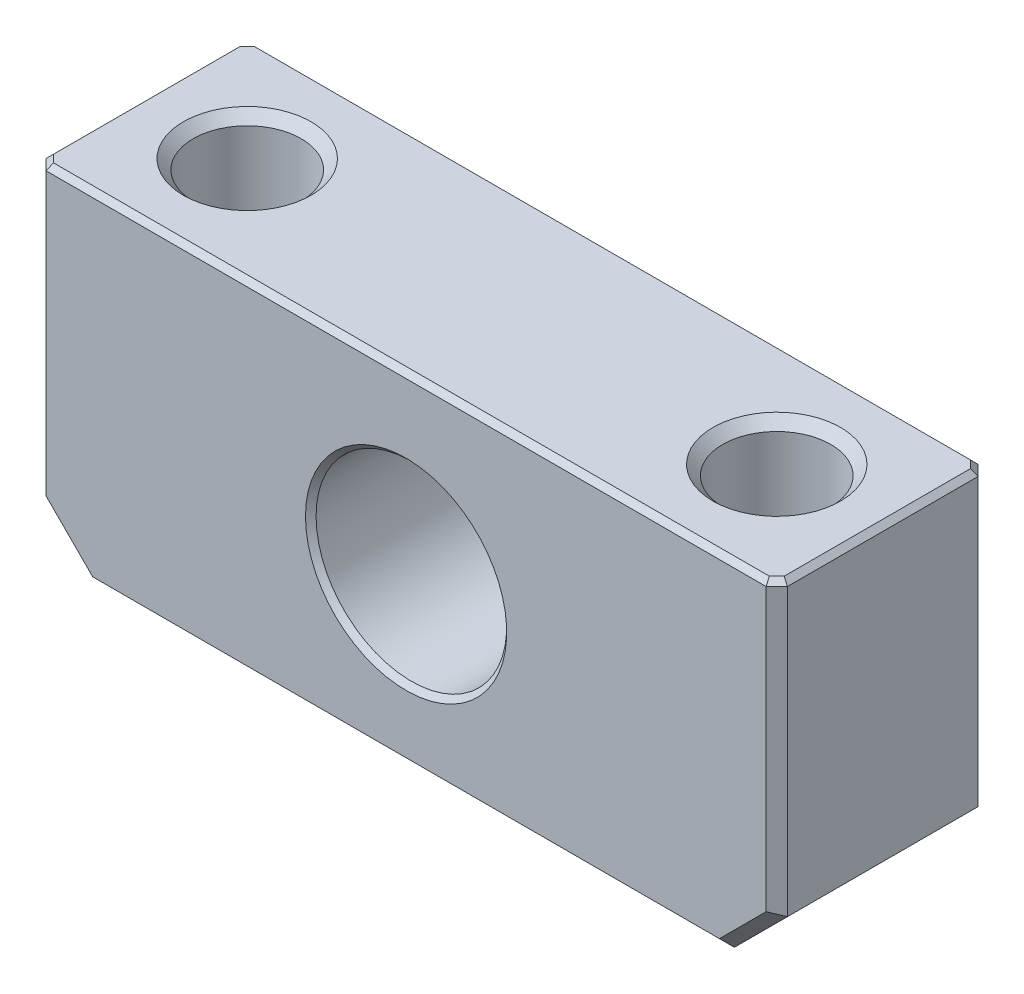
from build123d import *

# Parameters (mm, degrees)
VOLUME_DEPTH                   = 10
VOLUME_DEPTH_BACK              = 10
ESQUISSE1_W                    = 70
ESQUISSE1_H                    = 32.5
ESQUISSE1_R                    = 9
TROUS_TARAUD_S_M12_D           = 10.2
TROUS_TARAUD_S_M12_DEPTH       = 27
TROUS_TARAUD_S_M12_CSINK_D     = 12.05
TROUS_TARAUD_S_M12_CSINK_ANGLE = 90
TROUS_TARAUD_S_M12_TIP         = 3.064389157
CHANFREINS_5MM_SIZE            = 5
CHANFREINS_1MM_SIZE            = 1
CHANFREINS_0_5MM_SIZE          = 0.5


with BuildPart() as part:
    # Esquisse1 → Volume (new, two sides: drawn at the far end of the back side and taken through both)
    with BuildSketch(Plane.XY.offset(-VOLUME_DEPTH_BACK)):
        with Locations((0, 0.25)):
            Rectangle(ESQUISSE1_W, ESQUISSE1_H)
        Circle(ESQUISSE1_R, mode=Mode.SUBTRACT)
    extrude(amount=VOLUME_DEPTH + VOLUME_DEPTH_BACK)

    # Trous taraud_s M12
    with Locations(Plane(origin=(-25, 16.5, 0), x_dir=(0, 0, 1), z_dir=(0, 1, 0))):
        with Locations((0, 0), (0, 50)):
            CounterSinkHole(TROUS_TARAUD_S_M12_D / 2, TROUS_TARAUD_S_M12_CSINK_D / 2, depth=TROUS_TARAUD_S_M12_DEPTH, counter_sink_angle=TROUS_TARAUD_S_M12_CSINK_ANGLE)
            with Locations((0, 0, -(TROUS_TARAUD_S_M12_DEPTH + TROUS_TARAUD_S_M12_TIP / 2))):  # 118° drill point
                Cone(0, TROUS_TARAUD_S_M12_D / 2, TROUS_TARAUD_S_M12_TIP, mode=Mode.SUBTRACT)

    # Chanfreins 5mm
    chanfreins_5mm_edges = [part.edges().sort_by_distance(p)[0] for p in [
        (35, -16, 0),
        (-35, -16, 0),
    ]]
    chamfer(chanfreins_5mm_edges, length=CHANFREINS_5MM_SIZE)

    # Chanfreins 1mm
    chanfreins_1mm_edges = [part.edges().sort_by_distance(p)[0] for p in [
        (-35, 2.75, 10),
        (0, -16, 10),
        (35, 2.75, 10),
        (32.5, -13.5, 10),
        (-32.5, -13.5, 10),
        (0, -16, -10),
        (35, 2.75, -10),
        (32.5, -13.5, -10),
        (-32.5, -13.5, -10),
        (-35, 2.75, -10),
    ]]
    chamfer(chanfreins_1mm_edges, length=CHANFREINS_1MM_SIZE)

    # Chanfreins 0.5mm
    chanfreins_0_5mm_edges = [part.edges().sort_by_distance(p)[0] for p in [
        (-9, 0, -10),
        (-9, 0, 10),
        (0, 16.5, 10),
        (-35, 16.5, 0),
        (35, 16.5, 0),
        (0, 16.5, -10),
        (-34.5, 16.5, -9.5),
        (34.5, 16.5, -9.5),
        (-34.5, 16.5, 9.5),
        (34.5, 16.5, 9.5),
    ]]
    chamfer(chanfreins_0_5mm_edges, length=CHANFREINS_0_5MM_SIZE)


solid = part.part
